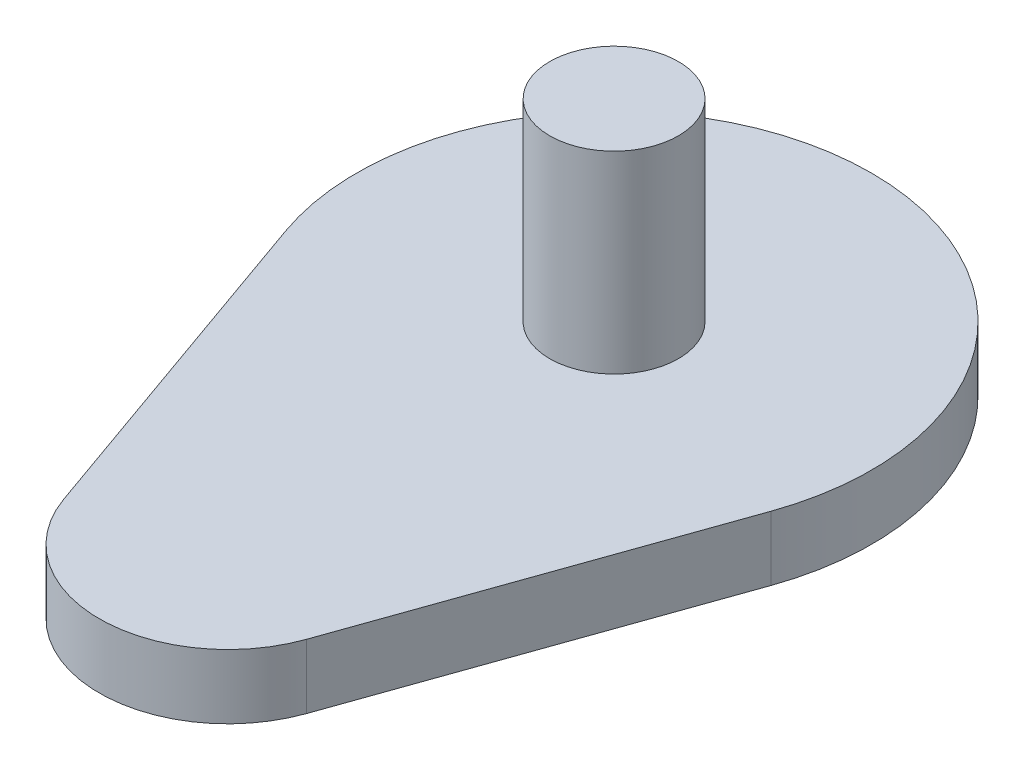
from build123d import *

# Parameters (mm, degrees)
SKETCH1_R                = 5
BOSS_EXTRUDE1_DEPTH      = 5
BOSS_EXTRUDE2_DEPTH      = 15
BOSS_EXTRUDE2_DEPTH_BACK = 5
SKETCH1_2_R              = 5


with BuildPart() as part:
    # Sketch1 → Boss-Extrude1 (new body)
    with BuildSketch(Plane(origin=(0, 0, 0), x_dir=(1, 0, 0), z_dir=(0, 1, 0))):
        with BuildLine():
            Line((-9.428090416, -33.333333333), (-18.856180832, -6.666666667))
            ThreePointArc((-18.856180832, -6.666666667), (0, 20), (18.856180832, -6.666666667))
            Line((18.856180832, -6.666666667), (9.428090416, -33.333333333))
            ThreePointArc((9.428090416, -33.333333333), (0, -40), (-9.428090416, -33.333333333))
        make_face()
        with Locations(Location((0, 0, 0), (0, 0, 270))):
            Circle(SKETCH1_R, mode=Mode.SUBTRACT)
    extrude(amount=-BOSS_EXTRUDE1_DEPTH)


with BuildPart() as body_2:
    # Sketch1_2 → Boss-Extrude2 (new, two sides: drawn at the far end of the back side and taken through both)
    with BuildSketch(Plane(origin=(0, 0, 0), x_dir=(1, 0, 0), z_dir=(0, 1, 0)).offset(-BOSS_EXTRUDE2_DEPTH_BACK)):
        with Locations(Location((0, 0, 0), (0, 0, 270))):
            Circle(SKETCH1_2_R)
    extrude(amount=BOSS_EXTRUDE2_DEPTH + BOSS_EXTRUDE2_DEPTH_BACK)


solid = Compound([part.part, body_2.part])
